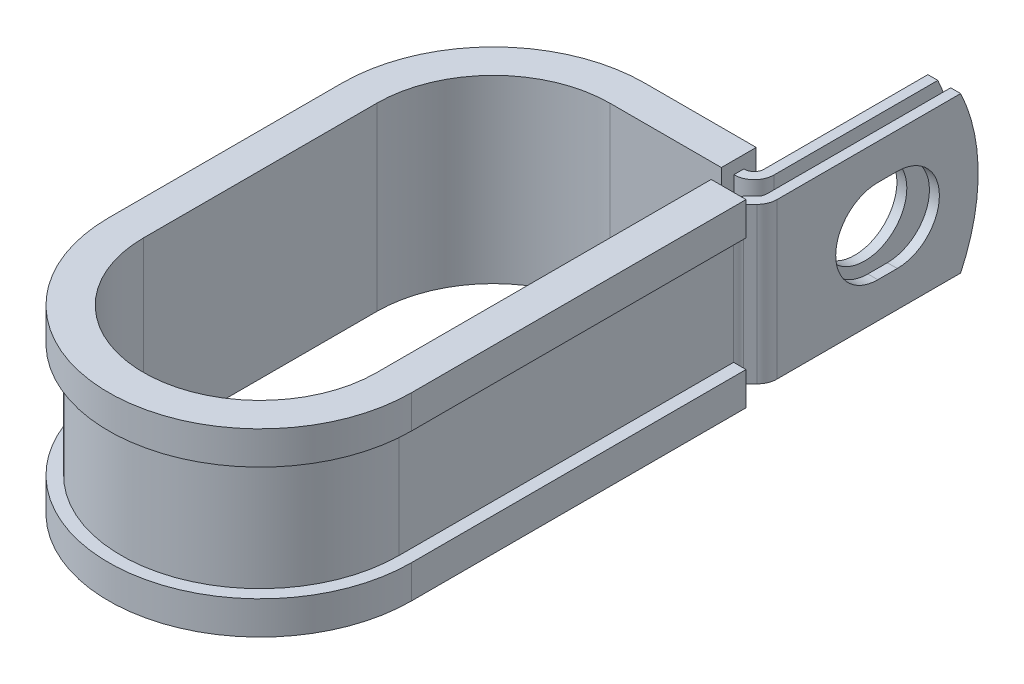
from build123d import *

# Parameters (mm, degrees)
EXTRUDE_THIN1_DEPTH = 9.525
SKETCH2_R           = 5.1562
CUT_EXTRUDE1_DEPTH  = 1.2192
CUT_EXTRUDE2_DEPTH  = 1.2192
CUT_EXTRUDE3_DEPTH  = 57.490099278


with BuildPart() as part:
    # Sketch1 → Extrude-Thin1 (new, symmetric)
    with BuildSketch(Plane(origin=(0, 0, 0), x_dir=(1, 0, 0), z_dir=(0, 1, 0))):
        with BuildLine():
            Line((17.7089698, 40.4622), (17.7089698, 15.8115))
            ThreePointArc((17.7089698, 15.8115), (17.616163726, 15.344932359), (17.351874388, 14.949395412))
            Line((17.351874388, 14.949395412), (16.525690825, 14.123211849))
            ThreePointArc((16.525690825, 14.123211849), (15.997112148, 13.332137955), (15.8115, 12.399002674))
            Line((15.8115, 12.399002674), (15.8115, 0))
            Line((15.8115, 0), (15.8115, -28.575))
            ThreePointArc((15.8115, -28.575), (0, -44.3865), (-15.8115, -28.575))
            Line((-15.8115, -28.575), (-15.8115, 0))
            ThreePointArc((-15.8115, 0), (-11.180418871, 11.180418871), (0, 15.8115))
            Line((0, 15.8115), (13.6957698, 15.8115))
            ThreePointArc((13.6957698, 15.8115), (15.419978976, 16.525690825), (16.1341698, 18.2499))
            Line((16.1341698, 18.2499), (16.1341698, 40.4622))
            Line((16.1341698, 40.4622), (14.9149698, 40.4622))
            Line((14.9149698, 40.4622), (14.9149698, 18.2499))
            ThreePointArc((14.9149698, 18.2499), (14.557874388, 17.387795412), (13.6957698, 17.0307))
            Line((13.6957698, 17.0307), (0, 17.0307))
            ThreePointArc((0, 17.0307), (-12.042523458, 12.042523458), (-17.0307, 0))
            Line((-17.0307, 0), (-17.0307, -28.575))
            ThreePointArc((-17.0307, -28.575), (0, -45.6057), (17.0307, -28.575))
            Line((17.0307, -28.575), (17.0307, 0))
            Line((17.0307, 0), (17.0307, 12.399002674))
            ThreePointArc((17.0307, 12.399002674), (17.123506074, 12.865570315), (17.387795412, 13.261107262))
            Line((17.387795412, 13.261107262), (18.213978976, 14.087290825))
            ThreePointArc((18.213978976, 14.087290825), (18.742557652, 14.878364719), (18.9281698, 15.8115))
            Line((18.9281698, 15.8115), (18.9281698, 40.4622))
            Line((18.9281698, 40.4622), (17.7089698, 40.4622))
        make_face()
    extrude(amount=EXTRUDE_THIN1_DEPTH, both=True)

    # Sketch2 → Cut-Extrude1 (cut)
    with BuildSketch(Plane.ZY.offset(-14.9149698)):
        with Locations((-29.3624, 0)):
            Circle(SKETCH2_R)
    extrude(amount=-CUT_EXTRUDE1_DEPTH, mode=Mode.SUBTRACT)

    # Sketch3 → Cut-Extrude2 (cut)
    with BuildSketch(Plane(origin=(18.9281698, 0, 0), x_dir=(0, 0, -1), z_dir=(1, 0, 0))):
        with BuildLine():
            Line((28.1686, 5.1562), (30.5562, 5.1562))
            ThreePointArc((30.5562, 5.1562), (35.7124, 0), (30.5562, -5.1562))
            Line((30.5562, -5.1562), (28.1686, -5.1562))
            ThreePointArc((28.1686, -5.1562), (23.0124, 0), (28.1686, 5.1562))
        make_face()
    extrude(amount=-CUT_EXTRUDE2_DEPTH, mode=Mode.SUBTRACT)

    # Sketch4 → Cut-Extrude3 (cut, through all)
    with BuildSketch(Plane.ZY.offset(-14.9149698)):
        with BuildLine():
            Line((-38.317663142, 9.525), (-40.4622, 9.525))
            Line((-40.4622, 9.525), (-40.4622, 0))
            ThreePointArc((-40.4622, 0), (-39.919438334, 4.881717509), (-38.317663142, 9.525))
        make_face()
        with BuildLine():
            ThreePointArc((-38.317663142, -9.525), (-39.919438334, -4.881717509), (-40.4622, 0))
            Line((-40.4622, 0), (-40.4622, -9.525))
            Line((-40.4622, -9.525), (-38.317663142, -9.525))
        make_face()
    extrude(amount=-CUT_EXTRUDE3_DEPTH, mode=Mode.SUBTRACT)

    # Sweep1: sweep along a path in Sketch6
    with BuildLine(Plane(origin=(0, 9.525, 0), x_dir=(1, 0, 0), z_dir=(0, 1, 0))) as sweep1_path:
        Line((14.2875, 12.399002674), (14.2875, 0))
        Line((14.2875, 0), (14.2875, -28.575))
        ThreePointArc((14.2875, -28.575), (0, -42.8625), (-14.2875, -28.575))
        Line((-14.2875, -28.575), (-14.2875, 0))
        ThreePointArc((-14.2875, 0), (-10.102788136, 10.102788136), (0, 14.2875))
        Line((0, 14.2875), (13.6449698, 14.2875))
    # Sketch5 → Sweep1 (sweep)
    with BuildSketch(Plane(origin=(0, 0, -12.399002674), x_dir=(-1, 0, 0), z_dir=(0, 0, -1))):
        Polygon((-17.0307, 9.525), (-15.8115, 9.525), (-15.8115, -9.525), (-17.0307, -9.525), (-17.0307, -6.985), (-18.5547, -6.985), (-18.5547, -11.049), (-14.2875, -11.049), (-14.2875, 11.049), (-18.5547, 11.049), (-18.5547, 6.985), (-17.0307, 6.985), align=None)
    sweep(path=sweep1_path.line)


solid = part.part
